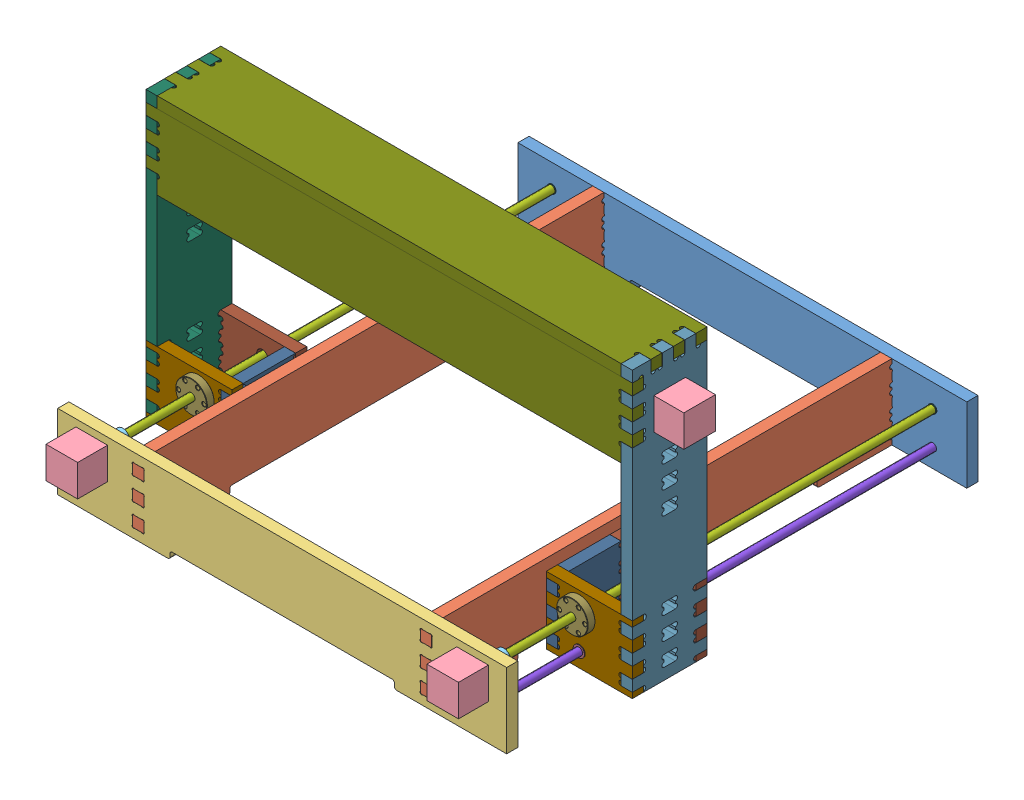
SolidWorks assembly unterbau.SLDASM, configuration Standard (file format 7000). Lengths in mm.
Overall size (690 385.35 670).
37 component instances, 16 part files, 56 mates.
Components (placement in the parent):
- front-1: front.SLDPRT [Standard] at (-265.6288 -95.6832 600) size (600 100 15)
- side-1: side.SLDPRT [Standard] at (-165.5288 -95.6332 1215) x (0 0 -1) z (1 0 0) size (630 100 15)
- side-2: side.SLDPRT [Standard] at (219.2712 -95.6332 1215) x (0 0 -1) z (1 0 0) size (630 100 15)
- back-1: back.SLDPRT [Standard] at (334.3712 -95.6332 1230) x (-1 0 0) z (0 0 -1) size (600 100 15)
- stepper-1: stepper.SLDPRT [Standard] at (310.0212 -47.2832 1270) x (-1 0 0) z (0 0 -1) size (42.3 42.3 64)
- stepper-2: stepper.SLDPRT [Standard] at (-198.9788 -47.2832 1270) x (-1 0 0) z (0 0 -1) size (42.3 42.3 64)
- kupplung-1: kupplung.SLDPRT [Standard] at (288.8712 -26.1332 1188.5) x (0.880226 0.474554 0) z (0 0 1) size (19 19 24.5)
- kupplung-2: kupplung.SLDPRT [Standard] at (-220.1288 -26.1332 1188.5) x (0.966347 -0.257243 0) z (0 0 1) size (19 19 24.5)
- gleitlager_klein-1: gleitlager_klein.SLDPRT [Standard] at (-220.1288 -26.1832 609) x (-0.923728 -0.383049 0) z (0 0 -1) size (11 11 7)
- gleitlager_klein-2: gleitlager_klein.SLDPRT [Standard] at (288.8712 -26.1832 609) x (-0.594495 0.804099 0) z (0 0 -1) size (11 11 7)
- trapezgewinde_unterbau-1: trapezgewinde_unterbau.SLDPRT [Standard] at (288.8712 -26.1832 616) x (0.417755 -0.90856 0) z (0 0 1) size (10 10 584)
- trapezgewinde_unterbau-2: trapezgewinde_unterbau.SLDPRT [Standard] at (-220.1288 -26.1832 616) x (-0.398672 0.917094 0) z (0 0 1) size (10 10 584)
- 10mm_rundstahl_unten-1: 10mm_rundstahl_unten.SLDPRT [Standard] at (-220.1288 -70.6332 607.5) x (0.857233 -0.514928 0) z (0 0 1) size (10 10 615)
- 10mm_rundstahl_unten-2: 10mm_rundstahl_unten.SLDPRT [Standard] at (288.8712 -70.6332 607.5) x (0.207608 -0.978212 0) z (0 0 1) size (10 10 615)
- portal_connection_right-1: portal_connection_right.SLDASM [Standard] at (-234.5996 -50.0916 964.5464) size (115 93.24 111)
  - connection-spindel-1: connection-spindel.SLDPRT [Standard] at (-56.0292 -40.5916 107.5) size (115 90 15)
  - connection-spindel-inner-side-1: connection-spindel-inner-side.SLDPRT [Standard] at (58.9708 -40.6416 22.5) x (0 0 1) z (-1 0 0) size (100 90 15)
  - connection-spindel-front-1: connection-spindel-front.SLDPRT [Standard] at (-56.0292 -40.5916 22.5) size (115 90 15)
  - WFRM_2525TR10x2_1-1: WFRM_2525TR10x2_1.sldasm [Standard] at (14.4708 23.9084 132.5) x (-0.5 -0.866025 0) z (0 0 -1) size (42 42 25)
    - ccLab_20164418254994_0-1: ccLab_20164418254994_0.sldprt [Standard] at (0 0 12.5) size (42 42 25)
  - gleitlager_groß-1: gleitlager_groß.SLDPRT [Standard] at (14.4708 -20.5916 33.5) size (15 15 12)
  - gleitlager_groß-2: gleitlager_groß.SLDPRT [Standard] at (14.4708 -20.5916 111.5) x (-0.923728 -0.383049 0) z (0 0 -1) size (15 15 12)
- portal_connection_left-1: portal_connection_left.SLDASM [Standard] at (303.3419 -50.0916 1194.5464) x (-1 0 0) z (0 0 -1) size (115 90.05 111)
  - connection-spindel-1: connection-spindel.SLDPRT [Standard] at (-56.0292 -40.5916 107.5) size (115 90 15)
  - connection-spindel-inner-side-1: connection-spindel-inner-side.SLDPRT [Standard] at (58.9708 -40.6416 107.5) x (0 0 1) z (-1 0 0) size (100 90 15)
  - connection-spindel-front-1: connection-spindel-front.SLDPRT [Standard] at (-56.0292 -40.5916 192.5) size (115 90 15)
  - WFRM_2525TR10x2_1-1: WFRM_2525TR10x2_1.sldasm [Standard] at (14.4708 23.9084 97.5) size (42 42 25)
    - ccLab_20164418254994_0-1: ccLab_20164418254994_0.sldprt [Standard] at (0 0 12.5) size (42 42 25)
  - gleitlager_groß-1: gleitlager_groß.SLDPRT [Standard] at (14.4708 -20.5916 118.5) size (15 15 12)
  - gleitlager_groß-2: gleitlager_groß.SLDPRT [Standard] at (14.4708 -20.5916 196.5) x (-0.923728 -0.383049 0) z (0 0 -1) size (15 15 12)
- connection-spindel-portal_left-1: connection-spindel-portal_left.SLDPRT [Standard] at (344.3712 -90.7332 1087.0464) x (0 0 -1) z (1 0 0) size (100 380.27 15)
- stepper-3: stepper.SLDPRT [Standard] at (399.3712 203.3873 1015.8964) x (0 0 1) z (-1 0 0) size (42.3 42.3 64)
- kupplung-3: kupplung.SLDPRT [Standard] at (317.8712 224.5373 1037.0464) x (0 0.290446 -0.956891) z (1 0 0) size (19 19 24.5)
- connection-spindel-portal_right-1: connection-spindel-portal_right.SLDPRT [Standard] at (-290.6288 -90.7332 1087.0464) x (0 0 -1) z (1 0 0) size (100 380.27 15)
- gleitlager_groß-1: gleitlager_groß.SLDPRT [Standard] at (-286.6288 224.5374 1037.0464) x (0 0 1) z (-1 0 0) size (15 15 12)
- portal_quer-1: portal_quer.SLDPRT [Standard] at (-275.6288 289.6668 987.0464) x (1 0 0) z (0 -1 0) size (650 100 15)
- portal_quer-2: portal_quer.SLDPRT [Standard] at (-275.6288 274.6668 1087.0464) x (1 0 0) z (0 0 -1) size (650 100 15)
Mates (geometry in assembly coordinates):
- Deckungsgleich1: coincident anti-aligned: plane of front-1 through (-265.6288 -95.6832 615) normal (0 0 1); plane of side-2 through (234.2712 -29.0332 615) normal (0 0 -1)
- Deckungsgleich2: coincident anti-aligned: plane of front-1 through (-265.6288 -95.6832 615) normal (0 0 1); plane of side-1 through (-150.5288 -29.0332 615) normal (0 0 -1)
- Deckungsgleich8: coincident anti-aligned: plane of side-1 through (-150.5288 -2.0332 1215) normal (0 0 1); plane of back-1 through (334.3712 -95.6332 1215) normal (0 0 -1)
- Deckungsgleich9: coincident aligned: plane of side-1 through (-150.5288 4.3668 1215) normal (0 1 0); plane of back-1 through (334.3712 4.3668 1215) normal (0 1 0)
- Deckungsgleich11: coincident anti-aligned: plane of back-1 through (334.3712 -95.6332 1230) normal (0 0 1); plane of stepper-2 through (-198.9788 -47.2832 1230) normal (0 0 -1)
- Deckungsgleich12: coincident anti-aligned: plane of back-1 through (334.3712 -95.6332 1230) normal (0 0 1); plane of stepper-1 through (310.0212 -47.2832 1230) normal (0 0 -1)
- Konzentrisch1: concentric aligned: circle of back-1; circle of stepper-1
- Konzentrisch2: concentric aligned: circle of back-1; circle of stepper-1
- Konzentrisch3: concentric aligned: circle of back-1; circle of stepper-2
- Konzentrisch4: concentric aligned: circle of back-1; circle of stepper-2
- Deckungsgleich13: coincident aligned: cylinder of stepper-1 through (288.8712 -26.1332 1206) axis (0 0 1) radius 2.5; circle of kupplung-1
- Deckungsgleich14: coincident anti-aligned: circle of stepper-2; plane of kupplung-2 through (-220.1288 -26.1332 1206) normal (0 0 1)
- Deckungsgleich15: coincident aligned: cylinder of stepper-2 through (-220.1288 -26.1332 1206) axis (0 0 1) radius 2.5; circle of kupplung-2
- Deckungsgleich16: coincident anti-aligned: plane of stepper-1 through (288.8712 -26.1332 1206) normal (0 0 -1); circle of kupplung-1
- Konzentrisch5: concentric anti-aligned: circle of front-1; cylinder of gleitlager_klein-1 through (-220.1288 -26.1832 609) axis (0 0 -1) radius 3.5
- Deckungsgleich17: coincident anti-aligned: plane of front-1 through (-265.6288 -95.6832 615) normal (0 0 1); circle of gleitlager_klein-1
- Konzentrisch6: concentric anti-aligned: cylinder of front-1 through (288.8712 -26.1832 600) axis (0 0 1) radius 3.525; cylinder of gleitlager_klein-2 through (288.8712 -26.1832 609) axis (0 0 -1) radius 3.5
- Deckungsgleich18: coincident anti-aligned: plane of front-1 through (-265.6288 -95.6832 615) normal (0 0 1); circle of gleitlager_klein-2
- Konzentrisch7: concentric aligned: cylinder of gleitlager_klein-2 through (288.8712 -26.1832 609) axis (0 0 -1) radius 2.5; circle of trapezgewinde_unterbau-1
- Deckungsgleich24: coincident anti-aligned: plane of gleitlager_klein-2 through (290.8814 -24.6969 616) normal (0 0 1); plane of trapezgewinde_unterbau-1 through (288.8712 -26.1832 616) normal (0 0 -1)
- Konzentrisch8: concentric anti-aligned: cylinder of gleitlager_klein-1 through (-220.1288 -26.1832 609) axis (0 0 -1) radius 2.5; cylinder of trapezgewinde_unterbau-2 through (-220.1288 -26.1832 609) axis (0 0 1) radius 2.5
- Deckungsgleich25: coincident anti-aligned: plane of gleitlager_klein-1 through (-221.0865 -23.8739 616) normal (0 0 1); plane of trapezgewinde_unterbau-2 through (-220.1288 -26.1832 616) normal (0 0 -1)
- Konzentrisch9: concentric aligned: cylinder of back-1 through (-220.1288 -70.6332 1222.5) axis (0 0 -1) radius 5.025; cylinder of 10mm_rundstahl_unten-1 through (-220.1288 -70.6332 1222.5) axis (0 0 -1) radius 5
- Konzentrisch10: concentric aligned: cylinder of back-1 through (288.8712 -70.6332 1222.5) axis (0 0 -1) radius 5.025; cylinder of 10mm_rundstahl_unten-2 through (288.8712 -70.6332 1222.5) axis (0 0 -1) radius 5
- Deckungsgleich26: coincident anti-aligned: plane of back-1 through (288.8712 -70.6332 1222.5) normal (0 0 -1); plane of 10mm_rundstahl_unten-2 through (288.8712 -70.6332 1222.5) normal (0 0 1)
- Deckungsgleich27: coincident anti-aligned: plane of back-1 through (-220.1288 -70.6332 1222.5) normal (0 0 -1); plane of 10mm_rundstahl_unten-1 through (-220.1288 -70.6332 1222.5) normal (0 0 1)
- Konzentrisch17: concentric anti-aligned: cylinder of trapezgewinde_unterbau-1 through (288.8712 -26.1832 1186) axis (0 0 -1) radius 5; cylinder of portal_connection_left-1/WFRM_2525TR10x2_1-1/ccLab_20164418254994_0-1 through (288.8712 -26.1832 1073.0464) axis (0 0 1) radius 4
- Parallel9: parallel aligned: plane of side-2 through (234.2712 -5.0332 615) normal (1 0 0); plane of portal_connection_left-1/connection-spindel-1 through (359.3712 -53.2332 1072.0464) normal (1 0 0)
- Deckungsgleich30: coincident aligned: cylinder of trapezgewinde_unterbau-2 through (-220.1288 -26.1832 1186) axis (0 0 -1) radius 5; circle of portal_connection_right-1/WFRM_2525TR10x2_1-1/ccLab_20164418254994_0-1
- Parallel10: parallel aligned: plane of side-1 through (-165.5288 -5.0332 615) normal (-1 0 0); plane of portal_connection_right-1/connection-spindel-inner-side-1 through (-190.6288 -5.1332 1002.0464) normal (-1 0 0)
- Deckungsgleich33: coincident aligned: plane of portal_connection_right-1/connection-spindel-front-1 through (-190.6288 -80.3332 987.0464) normal (0 0 -1); plane of portal_connection_left-1/connection-spindel-front-1 through (259.3712 -80.3332 987.0464) normal (0 0 -1)
- Deckungsgleich37: coincident anti-aligned: plane of portal_connection_left-1/connection-spindel-1 through (344.3712 -14.0332 1072.0464) normal (1 0 0); plane of connection-spindel-portal_left-1 through (344.3712 -4.3832 1072.0464) normal (-1 0 0)
- Abstand7: distance = 0.05 mm aligned: plane of portal_connection_left-1/connection-spindel-front-1 through (359.3712 -90.6832 987.0464) normal (0 -1 0); plane of connection-spindel-portal_left-1 through (359.3712 -90.7332 1002.0464) normal (0 -1 0)
- Deckungsgleich39: coincident anti-aligned: plane of portal_connection_left-1/connection-spindel-front-1 through (259.3712 -80.3332 1002.0464) normal (0 0 1); plane of connection-spindel-portal_left-1 through (359.3712 -29.1332 1002.0464) normal (0 0 -1)
- Deckungsgleich43: coincident anti-aligned: plane of connection-spindel-portal_left-1 through (359.3712 -4.3832 1072.0464) normal (1 0 0); plane of stepper-3 through (359.3712 203.3873 1015.8964) normal (-1 0 0)
- Konzentrisch20: concentric anti-aligned: cylinder of connection-spindel-portal_left-1 through (361.8712 224.5373 1037.0464) axis (-1 0 0) radius 12; cylinder of stepper-3 through (335.3712 224.5373 1037.0464) axis (1 0 0) radius 2.5
- Konzentrisch21: concentric aligned: cylinder of connection-spindel-portal_left-1 through (361.8712 240.0373 1021.5464) axis (-1 0 0) radius 3; circle of stepper-3
- Konzentrisch22: concentric anti-aligned: cylinder of stepper-3 through (335.3712 224.5373 1037.0464) axis (1 0 0) radius 2.5; cylinder of kupplung-3 through (324.8712 224.5373 1037.0464) axis (-1 0 0) radius 2.5
- Abstand9: distance = 7 mm anti-aligned: plane of stepper-3 through (335.3712 224.5373 1037.0464) normal (-1 0 0); plane of kupplung-3 through (342.3712 224.5373 1037.0464) normal (1 0 0)
- Deckungsgleich44: coincident aligned: plane of portal_connection_right-1/connection-spindel-front-1 through (-290.6288 -23.1332 1002.0464) normal (-1 0 0); plane of connection-spindel-portal_right-1 through (-290.6288 -4.3832 1072.0464) normal (-1 0 0)
- Abstand10: distance = 0.05 mm aligned: plane of portal_connection_right-1/connection-spindel-front-1 through (-290.6288 -90.6832 1002.0464) normal (0 -1 0); plane of connection-spindel-portal_right-1 through (-275.6288 -90.7332 1002.0464) normal (0 -1 0)
- Deckungsgleich46: coincident aligned: plane of portal_connection_right-1/connection-spindel-front-1 through (-190.6288 -80.3332 987.0464) normal (0 0 -1); plane of connection-spindel-portal_right-1 through (-275.6288 -0.6332 987.0464) normal (0 0 -1)
- Deckungsgleich48: coincident anti-aligned: plane of front-1 through (-265.6288 -95.6832 615) normal (0 0 1); plane of side-1 through (-150.5288 -29.0332 615) normal (0 0 -1)
- Deckungsgleich49: coincident anti-aligned: plane of front-1 through (-150.5288 -20.1332 600) normal (-1 0 0); plane of side-1 through (-150.5288 -5.0332 615) normal (1 0 0)
- Abstand11: distance = 0.05 mm aligned: plane of front-1 through (-265.6288 4.3168 615) normal (0 1 0); plane of side-1 through (-150.5288 4.3668 1215) normal (0 1 0)
- Deckungsgleich50: coincident anti-aligned: plane of side-1 through (-150.5288 -5.0332 615) normal (1 0 0); plane of back-1 through (-150.5288 -95.6332 1230) normal (-1 0 0)
- Abstand12: distance = 0.05 mm aligned: plane of side-2 through (234.2712 4.3668 1215) normal (0 1 0); plane of front-1 through (-265.6288 4.3168 615) normal (0 1 0)
- Deckungsgleich52: coincident anti-aligned: plane of front-1 through (219.2712 -95.6832 600) normal (1 0 0); plane of side-2 through (219.2712 -5.0332 615) normal (-1 0 0)
- Konzentrisch23: concentric anti-aligned: cylinder of connection-spindel-portal_right-1 through (-293.1288 224.5374 1037.0464) axis (1 0 0) radius 6.05; cylinder of gleitlager_groß-1 through (-286.6288 224.5374 1037.0464) axis (-1 0 0) radius 6
- Deckungsgleich53: coincident anti-aligned: plane of connection-spindel-portal_right-1 through (-275.6288 -4.3832 1072.0464) normal (1 0 0); plane of gleitlager_groß-1 through (-275.6288 232.0374 1037.0464) normal (-1 0 0)
- Deckungsgleich54: coincident aligned: plane of connection-spindel-portal_right-1 through (-275.6288 -0.6332 987.0464) normal (0 0 -1); plane of portal_quer-1 through (344.3712 274.6668 987.0464) normal (0 0 -1)
- Deckungsgleich55: coincident aligned: plane of connection-spindel-portal_right-1 through (-290.6288 -4.3832 1072.0464) normal (-1 0 0); plane of portal_quer-1 through (-290.6288 274.6668 1017.1464) normal (-1 0 0)
- Deckungsgleich56: coincident anti-aligned: plane of connection-spindel-portal_right-1 through (-275.6288 274.6668 995.8464) normal (0 1 0); plane of portal_quer-1 through (-275.6288 274.6668 1005.0464) normal (0 -1 0)
- Deckungsgleich57: coincident anti-aligned: plane of connection-spindel-portal_right-1 through (-275.6288 265.4374 1072.0464) normal (0 0 1); plane of portal_quer-2 through (-275.6288 256.6668 1072.0464) normal (0 0 -1)
- Deckungsgleich58: coincident anti-aligned: plane of portal_quer-1 through (-275.6288 274.6668 1005.0464) normal (0 -1 0); plane of portal_quer-2 through (344.3712 274.6668 1072.0464) normal (0 1 0)
- Deckungsgleich59: coincident aligned: plane of connection-spindel-portal_right-1 through (-290.6288 -4.3832 1072.0464) normal (-1 0 0); plane of portal_quer-2 through (-290.6288 274.6668 1072.0464) normal (-1 0 0)
